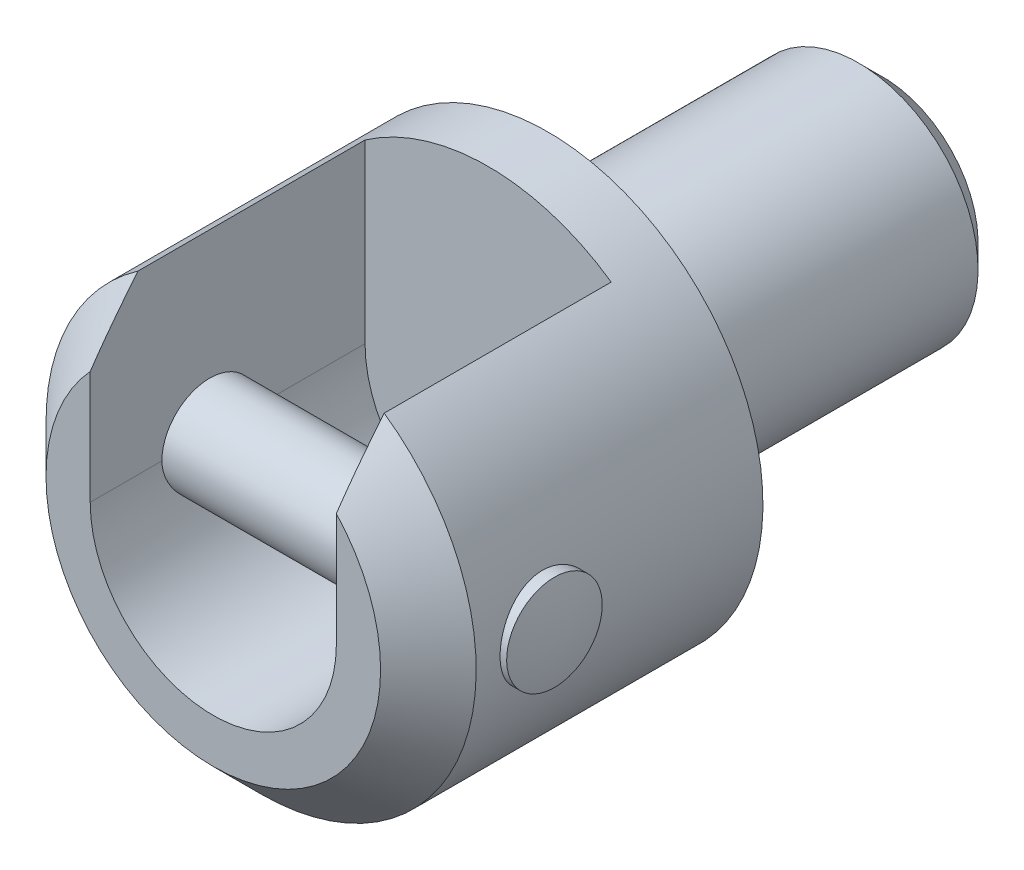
ISO-10303-21;
HEADER;
FILE_DESCRIPTION(('STEP AP214'),'2;1');
FILE_NAME('part.step','',(''),(''),'','','');
FILE_SCHEMA(('AUTOMOTIVE_DESIGN { 1 0 10303 214 1 1 1 1 }'));
ENDSEC;
DATA;
#1=APPLICATION_CONTEXT('core data for automotive mechanical design processes');
#2=APPLICATION_PROTOCOL_DEFINITION('international standard','automotive_design',2000,#1);
#3=PRODUCT_CONTEXT('',#1,'mechanical');
#4=PRODUCT('Part','Part','',(#3));
#5=PRODUCT_RELATED_PRODUCT_CATEGORY('part','',(#4));
#6=PRODUCT_DEFINITION_FORMATION('','',#4);
#7=PRODUCT_DEFINITION_CONTEXT('part definition',#1,'design');
#8=PRODUCT_DEFINITION('design','',#6,#7);
#9=PRODUCT_DEFINITION_SHAPE('','',#8);
#10=(LENGTH_UNIT() NAMED_UNIT(*) SI_UNIT(.MILLI.,.METRE.));
#11=(NAMED_UNIT(*) PLANE_ANGLE_UNIT() SI_UNIT($,.RADIAN.));
#12=(NAMED_UNIT(*) SI_UNIT($,.STERADIAN.) SOLID_ANGLE_UNIT());
#13=UNCERTAINTY_MEASURE_WITH_UNIT(LENGTH_MEASURE(1.E-05),#10,'distance_accuracy_value','');
#14=(GEOMETRIC_REPRESENTATION_CONTEXT(3) GLOBAL_UNCERTAINTY_ASSIGNED_CONTEXT((#13)) GLOBAL_UNIT_ASSIGNED_CONTEXT((#10,
#11,#12)) REPRESENTATION_CONTEXT('',''));
#15=CARTESIAN_POINT('',(0.,0.,0.));
#16=DIRECTION('',(0.,0.,1.));
#17=DIRECTION('',(1.,0.,0.));
#18=AXIS2_PLACEMENT_3D('',#15,#16,#17);
#19=CARTESIAN_POINT('',(0.,0.,-19.));
#20=DIRECTION('',(0.,0.,-1.));
#21=DIRECTION('',(0.,-1.,0.));
#22=AXIS2_PLACEMENT_3D('',#19,#20,#21);
#23=CYLINDRICAL_SURFACE('',#22,5.15);
#24=CARTESIAN_POINT('',(-4.745787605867,2.,9.));
#25=CARTESIAN_POINT('',(-4.74578221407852,2.00000555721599,9.10768759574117));
#26=CARTESIAN_POINT('',(-4.74949257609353,1.99127387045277,9.21534022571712));
#27=CARTESIAN_POINT('',(-4.76381867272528,1.95675210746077,9.42738123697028));
#28=CARTESIAN_POINT('',(-4.77443383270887,1.93096345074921,9.53176988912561));
#29=CARTESIAN_POINT('',(-4.80118956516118,1.86343197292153,9.73415403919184));
#30=CARTESIAN_POINT('',(-4.8173160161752,1.82172989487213,9.83216512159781));
#31=CARTESIAN_POINT('',(-4.85325373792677,1.72370105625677,10.0198390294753));
#32=CARTESIAN_POINT('',(-4.87306619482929,1.66736958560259,10.1094991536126));
#33=CARTESIAN_POINT('',(-4.91532813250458,1.53846039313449,10.2827132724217));
#34=CARTESIAN_POINT('',(-4.93785895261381,1.46522651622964,10.3657592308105));
#35=CARTESIAN_POINT('',(-4.98234317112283,1.30598076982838,10.5187528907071));
#36=CARTESIAN_POINT('',(-5.00429643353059,1.21996592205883,10.5886975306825));
#37=CARTESIAN_POINT('',(-5.04612768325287,1.03369463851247,10.7160006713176));
#38=CARTESIAN_POINT('',(-5.0658993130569,0.933030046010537,10.7728000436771));
#39=CARTESIAN_POINT('',(-5.10015492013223,0.722669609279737,10.8684440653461));
#40=CARTESIAN_POINT('',(-5.11464087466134,0.61297716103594,10.9072954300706));
#41=CARTESIAN_POINT('',(-5.13611497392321,0.393020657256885,10.9641380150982));
#42=CARTESIAN_POINT('',(-5.14341694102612,0.283014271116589,10.9830054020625));
#43=CARTESIAN_POINT('',(-5.15083081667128,0.0611704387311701,11.0021591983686));
#44=CARTESIAN_POINT('',(-5.15094523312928,-0.0506663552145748,11.0024520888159));
#45=CARTESIAN_POINT('',(-5.14416615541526,-0.266688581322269,10.9849430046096));
#46=CARTESIAN_POINT('',(-5.13764375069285,-0.370965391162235,10.9680992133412));
#47=CARTESIAN_POINT('',(-5.11881772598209,-0.575077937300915,10.9184161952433));
#48=CARTESIAN_POINT('',(-5.10651369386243,-0.674913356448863,10.8855758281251));
#49=CARTESIAN_POINT('',(-5.07710525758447,-0.869077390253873,10.8044235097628));
#50=CARTESIAN_POINT('',(-5.05993222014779,-0.963302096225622,10.7558888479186));
#51=CARTESIAN_POINT('',(-5.0225059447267,-1.14250906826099,10.6449286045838));
#52=CARTESIAN_POINT('',(-5.00225167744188,-1.22748822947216,10.5824983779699));
#53=CARTESIAN_POINT('',(-4.95924424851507,-1.39140954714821,10.4409792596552));
#54=CARTESIAN_POINT('',(-4.93641401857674,-1.46964567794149,10.3610947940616));
#55=CARTESIAN_POINT('',(-4.89181787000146,-1.61188932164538,10.1892271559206));
#56=CARTESIAN_POINT('',(-4.87005226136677,-1.67589270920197,10.0972404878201));
#57=CARTESIAN_POINT('',(-4.82954355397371,-1.78934089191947,9.90079948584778));
#58=CARTESIAN_POINT('',(-4.81089085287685,-1.83837640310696,9.79608860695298));
#59=CARTESIAN_POINT('',(-4.7797718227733,-1.91784369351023,9.57897888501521));
#60=CARTESIAN_POINT('',(-4.76730175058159,-1.94828673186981,9.46658474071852));
#61=CARTESIAN_POINT('',(-4.75085622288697,-1.98804023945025,9.24431318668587));
#62=CARTESIAN_POINT('',(-4.74642749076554,-1.99848032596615,9.13467170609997));
#63=CARTESIAN_POINT('',(-4.74527841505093,-2.00120953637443,8.9151380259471));
#64=CARTESIAN_POINT('',(-4.74855593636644,-1.99350368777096,8.80524590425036));
#65=CARTESIAN_POINT('',(-4.76198712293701,-1.96118636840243,8.5943723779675));
#66=CARTESIAN_POINT('',(-4.77177166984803,-1.93748144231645,8.49322572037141));
#67=CARTESIAN_POINT('',(-4.79666602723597,-1.87499807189,8.29640245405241));
#68=CARTESIAN_POINT('',(-4.81177697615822,-1.83621640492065,8.2007270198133));
#69=CARTESIAN_POINT('',(-4.84634763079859,-1.74297790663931,8.01338819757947));
#70=CARTESIAN_POINT('',(-4.86595449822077,-1.68796655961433,7.92202877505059));
#71=CARTESIAN_POINT('',(-4.90707269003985,-1.56440789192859,7.7494394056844));
#72=CARTESIAN_POINT('',(-4.92858475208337,-1.49585531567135,7.66821341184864));
#73=CARTESIAN_POINT('',(-4.9728788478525,-1.341581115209,7.51238823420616));
#74=CARTESIAN_POINT('',(-4.9956463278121,-1.25500228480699,7.43863052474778));
#75=CARTESIAN_POINT('',(-5.03848005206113,-1.07014454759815,7.30657421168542));
#76=CARTESIAN_POINT('',(-5.05854623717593,-0.971865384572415,7.24827594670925));
#77=CARTESIAN_POINT('',(-5.09374089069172,-0.766256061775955,7.1490953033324));
#78=CARTESIAN_POINT('',(-5.10887856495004,-0.658943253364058,7.10818041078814));
#79=CARTESIAN_POINT('',(-5.13251832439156,-0.438230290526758,7.0452353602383));
#80=CARTESIAN_POINT('',(-5.14102378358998,-0.324833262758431,7.02319559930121));
#81=CARTESIAN_POINT('',(-5.15009968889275,-0.102749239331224,6.99971709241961));
#82=CARTESIAN_POINT('',(-5.15112934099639,0.00579397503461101,6.99708598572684));
#83=CARTESIAN_POINT('',(-5.14635769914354,0.221715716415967,7.00938933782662));
#84=CARTESIAN_POINT('',(-5.14055733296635,0.329094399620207,7.02432141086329));
#85=CARTESIAN_POINT('',(-5.12299799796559,0.536607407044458,7.07048092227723));
#86=CARTESIAN_POINT('',(-5.11140824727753,0.636859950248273,7.10124630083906));
#87=CARTESIAN_POINT('',(-5.08349478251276,0.830774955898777,7.1777259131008));
#88=CARTESIAN_POINT('',(-5.06717017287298,0.924436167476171,7.22344297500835));
#89=CARTESIAN_POINT('',(-5.03052508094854,1.10695906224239,7.33076921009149));
#90=CARTESIAN_POINT('',(-5.01006219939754,1.19543739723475,7.3929807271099));
#91=CARTESIAN_POINT('',(-4.9676296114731,1.36105749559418,7.53060352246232));
#92=CARTESIAN_POINT('',(-4.94565935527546,1.43819508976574,7.60601963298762));
#93=CARTESIAN_POINT('',(-4.90112748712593,1.58352753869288,7.77305878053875));
#94=CARTESIAN_POINT('',(-4.87860456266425,1.65095267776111,7.86536457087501));
#95=CARTESIAN_POINT('',(-4.83690940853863,1.76939647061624,8.06069914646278));
#96=CARTESIAN_POINT('',(-4.81773801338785,1.82041104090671,8.16373059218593));
#97=CARTESIAN_POINT('',(-4.78400015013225,1.90740863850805,8.38594792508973));
#98=CARTESIAN_POINT('',(-4.76988789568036,1.94197429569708,8.50576593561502));
#99=CARTESIAN_POINT('',(-4.75078842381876,1.98825755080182,8.75040768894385));
#100=CARTESIAN_POINT('',(-4.74579385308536,1.99999356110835,8.87522731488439));
#101=CARTESIAN_POINT('',(-4.745787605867,2.,9.));
#102=B_SPLINE_CURVE_WITH_KNOTS('',3,(#24,#25,#26,#27,#28,#29,#30,#31,#32,#33,#34,#35,#36,#37,
#38,#39,#40,#41,#42,#43,#44,#45,#46,#47,#48,#49,#50,#51,#52,#53,#54,#55,#56,#57,#58,#59,#60,#61,
#62,#63,#64,#65,#66,#67,#68,#69,#70,#71,#72,#73,#74,#75,#76,#77,#78,#79,#80,#81,#82,#83,#84,#85,
#86,#87,#88,#89,#90,#91,#92,#93,#94,#95,#96,#97,#98,#99,#100,#101),.UNSPECIFIED.,.T.,.F.,(4,2,2,
2,2,2,2,2,2,2,2,2,2,2,2,2,2,2,2,2,2,2,2,2,2,2,2,2,2,2,2,2,2,2,2,2,2,2,4),(0.,0.322597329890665,
0.645167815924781,0.966917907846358,1.28877171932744,1.62625686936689,1.9638207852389,
2.31383058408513,2.66370931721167,2.99751772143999,3.33120965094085,3.64721630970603,
3.96324549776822,4.28397207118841,4.60480602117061,4.9456296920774,5.28655202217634,
5.63609937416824,5.98543483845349,6.31438296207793,6.64323995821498,6.95487354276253,
7.26657377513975,7.59048384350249,7.91451987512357,8.2608690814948,8.60722587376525,
8.95293195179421,9.29846204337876,9.62257277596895,9.94663948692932,10.2617442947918,
10.5769087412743,10.9057179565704,11.2346477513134,11.5824997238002,11.9304381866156,
12.3045187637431,12.6782975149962),.UNSPECIFIED.);
#103=CARTESIAN_POINT('',(-5.15,0.,11.));
#104=VERTEX_POINT('',#103);
#105=CARTESIAN_POINT('',(-5.15,0.,7.));
#106=VERTEX_POINT('',#105);
#107=EDGE_CURVE('E81',#104,#106,#102,.T.);
#108=ORIENTED_EDGE('',*,*,#107,.F.);
#109=DIRECTION('',(0.,0.,1.));
#110=VECTOR('',#109,1.);
#111=CARTESIAN_POINT('',(-5.15,0.,2.5));
#112=LINE('',#111,#110);
#113=CARTESIAN_POINT('',(-5.15,0.,14.));
#114=VERTEX_POINT('',#113);
#115=EDGE_CURVE('E69',#104,#114,#112,.T.);
#116=ORIENTED_EDGE('',*,*,#115,.T.);
#117=CARTESIAN_POINT('',(0.,0.,14.));
#118=DIRECTION('',(0.,0.,-1.));
#119=DIRECTION('',(0.,-1.,0.));
#120=AXIS2_PLACEMENT_3D('',#117,#118,#119);
#121=CIRCLE('',#120,5.15);
#122=CARTESIAN_POINT('',(5.15,0.,14.));
#123=VERTEX_POINT('',#122);
#124=EDGE_CURVE('E334',#123,#114,#121,.T.);
#125=ORIENTED_EDGE('',*,*,#124,.F.);
#126=DIRECTION('',(0.,0.,1.));
#127=VECTOR('',#126,1.);
#128=CARTESIAN_POINT('',(5.15,0.,2.5));
#129=LINE('',#128,#127);
#130=CARTESIAN_POINT('',(5.15,0.,11.));
#131=VERTEX_POINT('',#130);
#132=EDGE_CURVE('E366',#131,#123,#129,.T.);
#133=ORIENTED_EDGE('',*,*,#132,.F.);
#134=CARTESIAN_POINT('',(4.745787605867,2.,9.));
#135=CARTESIAN_POINT('',(4.74578221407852,2.00000555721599,8.89231240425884));
#136=CARTESIAN_POINT('',(4.74949257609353,1.99127387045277,8.78465977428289));
#137=CARTESIAN_POINT('',(4.76381867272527,1.95675210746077,8.57261876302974));
#138=CARTESIAN_POINT('',(4.77443383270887,1.93096345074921,8.46823011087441));
#139=CARTESIAN_POINT('',(4.80118956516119,1.86343197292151,8.26584596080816));
#140=CARTESIAN_POINT('',(4.81731601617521,1.82172989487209,8.16783487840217));
#141=CARTESIAN_POINT('',(4.85325373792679,1.72370105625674,7.9801609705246));
#142=CARTESIAN_POINT('',(4.87306619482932,1.66736958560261,7.89050084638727));
#143=CARTESIAN_POINT('',(4.9153281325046,1.5384603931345,7.71728672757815));
#144=CARTESIAN_POINT('',(4.93785895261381,1.4652265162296,7.63424076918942));
#145=CARTESIAN_POINT('',(4.98234317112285,1.30598076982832,7.48124710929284));
#146=CARTESIAN_POINT('',(5.00429643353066,1.21996592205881,7.41130246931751));
#147=CARTESIAN_POINT('',(5.04612768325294,1.03369463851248,7.28399932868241));
#148=CARTESIAN_POINT('',(5.06589931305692,0.933030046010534,7.22719995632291));
#149=CARTESIAN_POINT('',(5.10015492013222,0.722669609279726,7.13155593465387));
#150=CARTESIAN_POINT('',(5.11464087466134,0.612977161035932,7.0927045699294));
#151=CARTESIAN_POINT('',(5.13611497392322,0.393020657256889,7.03586198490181));
#152=CARTESIAN_POINT('',(5.14341694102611,0.283014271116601,7.01699459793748));
#153=CARTESIAN_POINT('',(5.15083081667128,0.06117043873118,6.99784080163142));
#154=CARTESIAN_POINT('',(5.15094523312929,-0.0506663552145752,6.99754791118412));
#155=CARTESIAN_POINT('',(5.14416615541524,-0.266688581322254,7.01505699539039));
#156=CARTESIAN_POINT('',(5.13764375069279,-0.370965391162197,7.03190078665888));
#157=CARTESIAN_POINT('',(5.11881772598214,-0.575077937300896,7.08158380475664));
#158=CARTESIAN_POINT('',(5.10651369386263,-0.674913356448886,7.11442417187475));
#159=CARTESIAN_POINT('',(5.07710525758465,-0.869077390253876,7.19557649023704));
#160=CARTESIAN_POINT('',(5.05993222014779,-0.963302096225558,7.24411115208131));
#161=CARTESIAN_POINT('',(5.02250594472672,-1.14250906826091,7.35507139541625));
#162=CARTESIAN_POINT('',(5.00225167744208,-1.22748822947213,7.41750162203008));
#163=CARTESIAN_POINT('',(4.9592442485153,-1.39140954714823,7.55902074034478));
#164=CARTESIAN_POINT('',(4.9364140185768,-1.46964567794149,7.63890520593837));
#165=CARTESIAN_POINT('',(4.89181787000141,-1.61188932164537,7.81077284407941));
#166=CARTESIAN_POINT('',(4.87005226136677,-1.67589270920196,7.90275951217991));
#167=CARTESIAN_POINT('',(4.82954355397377,-1.78934089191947,8.09920051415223));
#168=CARTESIAN_POINT('',(4.81089085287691,-1.83837640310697,8.20391139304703));
#169=CARTESIAN_POINT('',(4.77977182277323,-1.91784369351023,8.4210211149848));
#170=CARTESIAN_POINT('',(4.76730175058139,-1.94828673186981,8.53341525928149));
#171=CARTESIAN_POINT('',(4.75085622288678,-1.98804023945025,8.75568681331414));
#172=CARTESIAN_POINT('',(4.7464274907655,-1.99848032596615,8.86532829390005));
#173=CARTESIAN_POINT('',(4.74527841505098,-2.00120953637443,9.08486197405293));
#174=CARTESIAN_POINT('',(4.74855593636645,-1.99350368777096,9.19475409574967));
#175=CARTESIAN_POINT('',(4.761987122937,-1.96118636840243,9.40562762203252));
#176=CARTESIAN_POINT('',(4.77177166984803,-1.93748144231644,9.5067742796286));
#177=CARTESIAN_POINT('',(4.79666602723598,-1.87499807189,9.70359754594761));
#178=CARTESIAN_POINT('',(4.81177697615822,-1.83621640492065,9.79927298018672));
#179=CARTESIAN_POINT('',(4.84634763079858,-1.74297790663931,9.98661180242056));
#180=CARTESIAN_POINT('',(4.86595449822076,-1.68796655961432,10.0779712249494));
#181=CARTESIAN_POINT('',(4.90707269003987,-1.56440789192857,10.2505605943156));
#182=CARTESIAN_POINT('',(4.9285847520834,-1.49585531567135,10.3317865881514));
#183=CARTESIAN_POINT('',(4.97287884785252,-1.34158111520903,10.4876117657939));
#184=CARTESIAN_POINT('',(4.99564632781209,-1.25500228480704,10.5613694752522));
#185=CARTESIAN_POINT('',(5.03848005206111,-1.07014454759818,10.6934257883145));
#186=CARTESIAN_POINT('',(5.05854623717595,-0.971865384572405,10.7517240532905));
#187=CARTESIAN_POINT('',(5.09374089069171,-0.766256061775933,10.8509046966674));
#188=CARTESIAN_POINT('',(5.10887856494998,-0.658943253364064,10.8918195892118));
#189=CARTESIAN_POINT('',(5.13251832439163,-0.438230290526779,10.9547646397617));
#190=CARTESIAN_POINT('',(5.14102378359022,-0.32483326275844,10.9768044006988));
#191=CARTESIAN_POINT('',(5.15009968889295,-0.102749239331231,11.0002829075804));
#192=CARTESIAN_POINT('',(5.15112934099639,0.00579397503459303,11.0029140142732));
#193=CARTESIAN_POINT('',(5.14635769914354,0.221715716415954,10.9906106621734));
#194=CARTESIAN_POINT('',(5.14055733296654,0.32909439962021,10.9756785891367));
#195=CARTESIAN_POINT('',(5.12299799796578,0.536607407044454,10.9295190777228));
#196=CARTESIAN_POINT('',(5.11140824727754,0.636859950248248,10.898753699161));
#197=CARTESIAN_POINT('',(5.08349478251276,0.830774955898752,10.8222740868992));
#198=CARTESIAN_POINT('',(5.06717017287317,0.924436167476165,10.7765570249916));
#199=CARTESIAN_POINT('',(5.03052508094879,1.10695906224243,10.6692307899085));
#200=CARTESIAN_POINT('',(5.01006219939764,1.19543739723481,10.6070192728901));
#201=CARTESIAN_POINT('',(4.96762961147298,1.3610574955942,10.4693964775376));
#202=CARTESIAN_POINT('',(4.94565935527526,1.43819508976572,10.3939803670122));
#203=CARTESIAN_POINT('',(4.90112748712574,1.58352753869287,10.226941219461));
#204=CARTESIAN_POINT('',(4.87860456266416,1.6509526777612,10.1346354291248));
#205=CARTESIAN_POINT('',(4.83690940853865,1.76939647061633,9.93930085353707));
#206=CARTESIAN_POINT('',(4.81773801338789,1.82041104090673,9.83626940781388));
#207=CARTESIAN_POINT('',(4.78400015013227,1.90740863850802,9.61405207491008));
#208=CARTESIAN_POINT('',(4.76988789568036,1.94197429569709,9.49423406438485));
#209=CARTESIAN_POINT('',(4.75078842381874,1.98825755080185,9.24959231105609));
#210=CARTESIAN_POINT('',(4.74579385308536,1.99999356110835,9.12477268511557));
#211=CARTESIAN_POINT('',(4.745787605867,2.,9.));
#212=B_SPLINE_CURVE_WITH_KNOTS('',3,(#134,#135,#136,#137,#138,#139,#140,#141,#142,#143,#144,
#145,#146,#147,#148,#149,#150,#151,#152,#153,#154,#155,#156,#157,#158,#159,#160,#161,#162,#163,
#164,#165,#166,#167,#168,#169,#170,#171,#172,#173,#174,#175,#176,#177,#178,#179,#180,#181,#182,
#183,#184,#185,#186,#187,#188,#189,#190,#191,#192,#193,#194,#195,#196,#197,#198,#199,#200,#201,
#202,#203,#204,#205,#206,#207,#208,#209,#210,#211),.UNSPECIFIED.,.T.,.F.,(4,2,2,2,2,2,2,2,2,2,2,
2,2,2,2,2,2,2,2,2,2,2,2,2,2,2,2,2,2,2,2,2,2,2,2,2,2,2,4),(0.,0.322597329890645,
0.645167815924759,0.966917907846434,1.28877171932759,1.62625686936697,1.96382078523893,
2.31383058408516,2.66370931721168,2.99751772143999,3.33120965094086,3.64721630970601,
3.96324549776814,4.28397207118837,4.60480602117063,4.94562969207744,5.28655202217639,
5.6360993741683,5.98543483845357,6.31438296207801,6.64323995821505,6.9548735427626,
7.26657377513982,7.59048384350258,7.91451987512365,8.2608690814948,8.60722587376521,
8.95293195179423,9.29846204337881,9.62257277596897,9.94663948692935,10.2617442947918,
10.5769087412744,10.9057179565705,11.2346477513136,11.5824997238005,11.9304381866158,
12.3045187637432,12.6782975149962),.UNSPECIFIED.);
#213=CARTESIAN_POINT('',(5.15,0.,7.));
#214=VERTEX_POINT('',#213);
#215=EDGE_CURVE('E96',#214,#131,#212,.T.);
#216=ORIENTED_EDGE('',*,*,#215,.F.);
#217=CARTESIAN_POINT('',(5.15,0.,2.5));
#218=VERTEX_POINT('',#217);
#219=EDGE_CURVE('E365',#218,#214,#129,.T.);
#220=ORIENTED_EDGE('',*,*,#219,.F.);
#221=CARTESIAN_POINT('',(0.,0.,2.5));
#222=DIRECTION('',(0.,0.,-1.));
#223=DIRECTION('',(0.,-1.,0.));
#224=AXIS2_PLACEMENT_3D('',#221,#222,#223);
#225=CIRCLE('',#224,5.15);
#226=CARTESIAN_POINT('',(-5.15,0.,2.5));
#227=VERTEX_POINT('',#226);
#228=EDGE_CURVE('E336',#218,#227,#225,.T.);
#229=ORIENTED_EDGE('',*,*,#228,.T.);
#230=EDGE_CURVE('E77',#227,#106,#112,.T.);
#231=ORIENTED_EDGE('',*,*,#230,.T.);
#232=EDGE_LOOP('',(#108,#116,#125,#133,#216,#220,#229,#231));
#233=FACE_BOUND('',#232,.T.);
#234=ADVANCED_FACE('F14',(#233),#23,.F.);
#235=CARTESIAN_POINT('',(0.,0.,-19.));
#236=DIRECTION('',(0.,0.,-1.));
#237=DIRECTION('',(0.,-1.,0.));
#238=AXIS2_PLACEMENT_3D('',#235,#236,#237);
#239=CYLINDRICAL_SURFACE('',#238,9.);
#240=CARTESIAN_POINT('',(8.774964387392,2.,9.));
#241=CARTESIAN_POINT('',(8.7749666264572,1.99999624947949,8.88915763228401));
#242=CARTESIAN_POINT('',(8.77708745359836,1.99075413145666,8.77827058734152));
#243=CARTESIAN_POINT('',(8.78532539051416,1.95407223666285,8.55965317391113));
#244=CARTESIAN_POINT('',(8.79144532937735,1.92661957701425,8.45192509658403));
#245=CARTESIAN_POINT('',(8.80695492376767,1.85442638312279,8.24281957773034));
#246=CARTESIAN_POINT('',(8.81634092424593,1.8097051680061,8.1414351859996));
#247=CARTESIAN_POINT('',(8.83732066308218,1.70430003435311,7.94760499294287));
#248=CARTESIAN_POINT('',(8.84891437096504,1.64361633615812,7.85515906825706));
#249=CARTESIAN_POINT('',(8.8732290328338,1.50688107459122,7.68021742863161));
#250=CARTESIAN_POINT('',(8.88596479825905,1.43060369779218,7.59790023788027));
#251=CARTESIAN_POINT('',(8.91099903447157,1.26533367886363,7.44711724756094));
#252=CARTESIAN_POINT('',(8.92329747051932,1.17634002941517,7.3786525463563));
#253=CARTESIAN_POINT('',(8.94623292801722,0.986963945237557,7.25680924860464));
#254=CARTESIAN_POINT('',(8.95685043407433,0.88646821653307,7.20360275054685));
#255=CARTESIAN_POINT('',(8.97506024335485,0.67768633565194,7.11490019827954));
#256=CARTESIAN_POINT('',(8.98265289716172,0.569401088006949,7.07940209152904));
#257=CARTESIAN_POINT('',(8.99385284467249,0.349970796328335,7.02768656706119));
#258=CARTESIAN_POINT('',(8.99752254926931,0.238900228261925,7.0111668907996));
#259=CARTESIAN_POINT('',(9.00067948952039,0.0155076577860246,6.99693172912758));
#260=CARTESIAN_POINT('',(9.00016721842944,-0.0968141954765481,6.99921402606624));
#261=CARTESIAN_POINT('',(8.9950654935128,-0.317435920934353,7.02229372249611));
#262=CARTESIAN_POINT('',(8.99054779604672,-0.425771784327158,7.04276527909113));
#263=CARTESIAN_POINT('',(8.97802477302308,-0.637430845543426,7.10112266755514));
#264=CARTESIAN_POINT('',(8.97001928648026,-0.740753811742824,7.13900930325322));
#265=CARTESIAN_POINT('',(8.95130538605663,-0.940353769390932,7.23140697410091));
#266=CARTESIAN_POINT('',(8.94057712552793,-1.036572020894,7.28604071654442));
#267=CARTESIAN_POINT('',(8.91759271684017,-1.21859313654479,7.41029009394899));
#268=CARTESIAN_POINT('',(8.90533635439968,-1.30439453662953,7.47990783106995));
#269=CARTESIAN_POINT('',(8.88033165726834,-1.46508498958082,7.63392019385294));
#270=CARTESIAN_POINT('',(8.86757840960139,-1.53970021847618,7.71859997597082));
#271=CARTESIAN_POINT('',(8.84326321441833,-1.67372303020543,7.89940274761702));
#272=CARTESIAN_POINT('',(8.83170130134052,-1.73313017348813,7.99552606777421));
#273=CARTESIAN_POINT('',(8.811064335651,-1.83517765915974,8.19693988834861));
#274=CARTESIAN_POINT('',(8.80199720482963,-1.87776477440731,8.30225822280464));
#275=CARTESIAN_POINT('',(8.78748514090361,-1.94455269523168,8.51880617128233));
#276=CARTESIAN_POINT('',(8.78203961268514,-1.96875652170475,8.63003481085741));
#277=CARTESIAN_POINT('',(8.77550908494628,-1.99766298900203,8.85273998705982));
#278=CARTESIAN_POINT('',(8.77433480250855,-2.00276498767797,8.96416213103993));
#279=CARTESIAN_POINT('',(8.77623864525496,-1.99440547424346,9.18626492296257));
#280=CARTESIAN_POINT('',(8.77931646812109,-1.98094528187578,9.29694562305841));
#281=CARTESIAN_POINT('',(8.7892932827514,-1.93619037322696,9.51302353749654));
#282=CARTESIAN_POINT('',(8.79614483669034,-1.90511692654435,9.61846897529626));
#283=CARTESIAN_POINT('',(8.81285408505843,-1.82625775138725,9.82265663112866));
#284=CARTESIAN_POINT('',(8.8227120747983,-1.77847038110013,9.92139818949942));
#285=CARTESIAN_POINT('',(8.84451874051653,-1.66666470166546,10.1110996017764));
#286=CARTESIAN_POINT('',(8.8564980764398,-1.60240114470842,10.2019113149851));
#287=CARTESIAN_POINT('',(8.88111742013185,-1.45978704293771,10.3716083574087));
#288=CARTESIAN_POINT('',(8.89375751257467,-1.38143468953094,10.4504921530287));
#289=CARTESIAN_POINT('',(8.91856933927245,-1.2110572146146,10.5956513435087));
#290=CARTESIAN_POINT('',(8.9307273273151,-1.11879740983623,10.6616540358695));
#291=CARTESIAN_POINT('',(8.95294911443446,-0.924268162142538,10.777224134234));
#292=CARTESIAN_POINT('',(8.96301301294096,-0.821999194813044,10.8267923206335));
#293=CARTESIAN_POINT('',(8.97985488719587,-0.611001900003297,10.9077101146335));
#294=CARTESIAN_POINT('',(8.9866540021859,-0.502320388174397,10.9391771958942));
#295=CARTESIAN_POINT('',(8.99629176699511,-0.281045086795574,10.9833651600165));
#296=CARTESIAN_POINT('',(8.99913101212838,-0.168451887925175,10.9960888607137));
#297=CARTESIAN_POINT('',(9.00051075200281,0.05486484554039,11.0022987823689));
#298=CARTESIAN_POINT('',(8.99914211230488,0.165576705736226,10.9961916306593));
#299=CARTESIAN_POINT('',(8.99245526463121,0.384354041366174,10.9658250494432));
#300=CARTESIAN_POINT('',(8.9871371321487,0.492419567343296,10.9415659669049));
#301=CARTESIAN_POINT('',(8.97315637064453,0.702510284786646,10.8757816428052));
#302=CARTESIAN_POINT('',(8.96450524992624,0.804554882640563,10.8343157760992));
#303=CARTESIAN_POINT('',(8.94478087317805,1.00029152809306,10.7353521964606));
#304=CARTESIAN_POINT('',(8.9337073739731,1.09398273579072,10.6778528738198));
#305=CARTESIAN_POINT('',(8.91007482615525,1.27233089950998,10.5471377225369));
#306=CARTESIAN_POINT('',(8.89749099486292,1.35677575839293,10.4736369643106));
#307=CARTESIAN_POINT('',(8.87238707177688,1.51227173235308,10.3135778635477));
#308=CARTESIAN_POINT('',(8.85986699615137,1.58331959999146,10.22701636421));
#309=CARTESIAN_POINT('',(8.83611370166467,1.71095851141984,10.0418455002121));
#310=CARTESIAN_POINT('',(8.82490079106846,1.76733485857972,9.94308538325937));
#311=CARTESIAN_POINT('',(8.80528840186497,1.86260026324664,9.73726310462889));
#312=CARTESIAN_POINT('',(8.79688657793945,1.90150390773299,9.63020795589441));
#313=CARTESIAN_POINT('',(8.78537621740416,1.95389349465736,9.43589352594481));
#314=CARTESIAN_POINT('',(8.78149804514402,1.97114982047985,9.34967657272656));
#315=CARTESIAN_POINT('',(8.7762913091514,1.99420426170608,9.17564904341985));
#316=CARTESIAN_POINT('',(8.77496261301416,2.00000297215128,9.08783855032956));
#317=CARTESIAN_POINT('',(8.774964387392,2.,9.));
#318=B_SPLINE_CURVE_WITH_KNOTS('',3,(#240,#241,#242,#243,#244,#245,#246,#247,#248,#249,#250,
#251,#252,#253,#254,#255,#256,#257,#258,#259,#260,#261,#262,#263,#264,#265,#266,#267,#268,#269,
#270,#271,#272,#273,#274,#275,#276,#277,#278,#279,#280,#281,#282,#283,#284,#285,#286,#287,#288,
#289,#290,#291,#292,#293,#294,#295,#296,#297,#298,#299,#300,#301,#302,#303,#304,#305,#306,#307,
#308,#309,#310,#311,#312,#313,#314,#315,#316,#317),.UNSPECIFIED.,.T.,.F.,(4,2,2,2,2,2,2,2,2,2,2,
2,2,2,2,2,2,2,2,2,2,2,2,2,2,2,2,2,2,2,2,2,2,2,2,2,2,2,4),(0.,0.33220511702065,0.664645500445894,
0.996715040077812,1.32877999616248,1.66604593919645,2.00333861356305,2.3442981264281,
2.68521811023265,3.02062971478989,3.35600175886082,3.68548441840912,4.01498228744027,
4.34695458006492,4.67897347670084,5.01812047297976,5.35727727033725,5.69749889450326,
6.03766459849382,6.37067749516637,6.70366671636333,7.0325625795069,7.36149075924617,
7.695632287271,8.02981674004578,8.37045046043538,8.71106800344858,9.04944929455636,
9.38777970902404,9.71885587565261,10.0499257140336,10.3798625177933,10.7098324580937,
11.0462446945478,11.3827383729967,11.7239097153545,12.064795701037,12.3280698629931,
12.5913303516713),.UNSPECIFIED.);
#319=CARTESIAN_POINT('',(8.774964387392,2.,9.));
#320=VERTEX_POINT('',#319);
#321=EDGE_CURVE('E98',#320,#320,#318,.T.);
#322=ORIENTED_EDGE('',*,*,#321,.T.);
#323=EDGE_LOOP('',(#322));
#324=FACE_BOUND('',#323,.T.);
#325=DIRECTION('',(0.,0.,-1.));
#326=VECTOR('',#325,1.);
#327=CARTESIAN_POINT('',(5.15,7.38088748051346,-19.));
#328=LINE('',#327,#326);
#329=CARTESIAN_POINT('',(5.15,7.38088748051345,12.));
#330=VERTEX_POINT('',#329);
#331=CARTESIAN_POINT('',(5.15,7.38088748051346,2.5));
#332=VERTEX_POINT('',#331);
#333=EDGE_CURVE('E311',#330,#332,#328,.T.);
#334=ORIENTED_EDGE('',*,*,#333,.F.);
#335=CARTESIAN_POINT('',(0.,0.,12.));
#336=DIRECTION('',(0.,0.,-1.));
#337=DIRECTION('',(0.,-1.,0.));
#338=AXIS2_PLACEMENT_3D('',#335,#336,#337);
#339=CIRCLE('',#338,9.);
#340=CARTESIAN_POINT('',(-5.15,7.38088748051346,12.));
#341=VERTEX_POINT('',#340);
#342=EDGE_CURVE('E319',#330,#341,#339,.T.);
#343=ORIENTED_EDGE('',*,*,#342,.T.);
#344=DIRECTION('',(0.,0.,-1.));
#345=VECTOR('',#344,1.);
#346=CARTESIAN_POINT('',(-5.15,7.38088748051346,-19.));
#347=LINE('',#346,#345);
#348=CARTESIAN_POINT('',(-5.15,7.38088748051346,2.5));
#349=VERTEX_POINT('',#348);
#350=EDGE_CURVE('E354',#349,#341,#347,.F.);
#351=ORIENTED_EDGE('',*,*,#350,.F.);
#352=CARTESIAN_POINT('',(0.,0.,2.5));
#353=DIRECTION('',(0.,0.,-1.));
#354=DIRECTION('',(0.,-1.,0.));
#355=AXIS2_PLACEMENT_3D('',#352,#353,#354);
#356=CIRCLE('',#355,9.);
#357=EDGE_CURVE('E344',#332,#349,#356,.F.);
#358=ORIENTED_EDGE('',*,*,#357,.F.);
#359=EDGE_LOOP('',(#334,#343,#351,#358));
#360=FACE_BOUND('',#359,.T.);
#361=CARTESIAN_POINT('',(0.,0.,0.));
#362=DIRECTION('',(0.,0.,-1.));
#363=DIRECTION('',(0.,-1.,0.));
#364=AXIS2_PLACEMENT_3D('',#361,#362,#363);
#365=CIRCLE('',#364,9.);
#366=CARTESIAN_POINT('',(0.,-9.,0.));
#367=VERTEX_POINT('',#366);
#368=EDGE_CURVE('E316',#367,#367,#365,.T.);
#369=ORIENTED_EDGE('',*,*,#368,.F.);
#370=EDGE_LOOP('',(#369));
#371=FACE_BOUND('',#370,.T.);
#372=CARTESIAN_POINT('',(-8.7749643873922,2.,9.));
#373=CARTESIAN_POINT('',(-8.77496662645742,1.99999624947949,9.11084236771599));
#374=CARTESIAN_POINT('',(-8.77708745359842,1.99075413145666,9.22172941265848));
#375=CARTESIAN_POINT('',(-8.7853253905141,1.95407223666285,9.44034682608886));
#376=CARTESIAN_POINT('',(-8.79144532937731,1.92661957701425,9.54807490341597));
#377=CARTESIAN_POINT('',(-8.80695492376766,1.85442638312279,9.75718042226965));
#378=CARTESIAN_POINT('',(-8.81634092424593,1.8097051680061,9.85856481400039));
#379=CARTESIAN_POINT('',(-8.83732066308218,1.70430003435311,10.0523950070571));
#380=CARTESIAN_POINT('',(-8.84891437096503,1.64361633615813,10.1448409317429));
#381=CARTESIAN_POINT('',(-8.87322903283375,1.50688107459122,10.3197825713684));
#382=CARTESIAN_POINT('',(-8.88596479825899,1.43060369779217,10.4020997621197));
#383=CARTESIAN_POINT('',(-8.91099903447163,1.26533367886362,10.5528827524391));
#384=CARTESIAN_POINT('',(-8.92329747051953,1.17634002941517,10.6213474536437));
#385=CARTESIAN_POINT('',(-8.94623292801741,0.986963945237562,10.7431907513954));
#386=CARTESIAN_POINT('',(-8.95685043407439,0.886468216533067,10.7963972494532));
#387=CARTESIAN_POINT('',(-8.9750602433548,0.677686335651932,10.8850998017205));
#388=CARTESIAN_POINT('',(-8.9826528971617,0.569401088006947,10.920597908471));
#389=CARTESIAN_POINT('',(-8.99385284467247,0.349970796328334,10.9723134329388));
#390=CARTESIAN_POINT('',(-8.99752254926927,0.238900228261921,10.9888331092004));
#391=CARTESIAN_POINT('',(-9.00067948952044,0.01550765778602,11.0030682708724));
#392=CARTESIAN_POINT('',(-9.00016721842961,-0.0968141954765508,11.0007859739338));
#393=CARTESIAN_POINT('',(-8.995065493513,-0.317435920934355,10.9777062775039));
#394=CARTESIAN_POINT('',(-8.99054779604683,-0.42577178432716,10.9572347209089));
#395=CARTESIAN_POINT('',(-8.97802477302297,-0.637430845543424,10.8988773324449));
#396=CARTESIAN_POINT('',(-8.97001928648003,-0.740753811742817,10.8609906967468));
#397=CARTESIAN_POINT('',(-8.95130538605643,-0.94035376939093,10.7685930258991));
#398=CARTESIAN_POINT('',(-8.94057712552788,-1.03657202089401,10.7139592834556));
#399=CARTESIAN_POINT('',(-8.91759271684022,-1.2185931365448,10.589709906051));
#400=CARTESIAN_POINT('',(-8.90533635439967,-1.30439453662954,10.5200921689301));
#401=CARTESIAN_POINT('',(-8.8803316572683,-1.46508498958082,10.3660798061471));
#402=CARTESIAN_POINT('',(-8.86757840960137,-1.53970021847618,10.2814000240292));
#403=CARTESIAN_POINT('',(-8.84326321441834,-1.67372303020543,10.100597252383));
#404=CARTESIAN_POINT('',(-8.83170130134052,-1.73313017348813,10.0044739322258));
#405=CARTESIAN_POINT('',(-8.811064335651,-1.83517765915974,9.80306011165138));
#406=CARTESIAN_POINT('',(-8.80199720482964,-1.87776477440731,9.69774177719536));
#407=CARTESIAN_POINT('',(-8.7874851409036,-1.94455269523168,9.48119382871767));
#408=CARTESIAN_POINT('',(-8.78203961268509,-1.96875652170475,9.3699651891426));
#409=CARTESIAN_POINT('',(-8.77550908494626,-1.99766298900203,9.14726001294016));
#410=CARTESIAN_POINT('',(-8.77433480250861,-2.00276498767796,9.03583786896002));
#411=CARTESIAN_POINT('',(-8.7762386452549,-1.99440547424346,8.81373507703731));
#412=CARTESIAN_POINT('',(-8.77931646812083,-1.98094528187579,8.70305437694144));
#413=CARTESIAN_POINT('',(-8.78929328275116,-1.93619037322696,8.48697646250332));
#414=CARTESIAN_POINT('',(-8.79614483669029,-1.90511692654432,8.38153102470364));
#415=CARTESIAN_POINT('',(-8.8128540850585,-1.82625775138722,8.1773433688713));
#416=CARTESIAN_POINT('',(-8.82271207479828,-1.77847038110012,8.07860181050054));
#417=CARTESIAN_POINT('',(-8.84451874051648,-1.66666470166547,7.88890039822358));
#418=CARTESIAN_POINT('',(-8.8564980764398,-1.60240114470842,7.79808868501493));
#419=CARTESIAN_POINT('',(-8.88111742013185,-1.4597870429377,7.62839164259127));
#420=CARTESIAN_POINT('',(-8.89375751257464,-1.38143468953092,7.54950784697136));
#421=CARTESIAN_POINT('',(-8.91856933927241,-1.21105721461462,7.40434865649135));
#422=CARTESIAN_POINT('',(-8.9307273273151,-1.11879740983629,7.3383459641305));
#423=CARTESIAN_POINT('',(-8.95294911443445,-0.924268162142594,7.22277586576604));
#424=CARTESIAN_POINT('',(-8.96301301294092,-0.821999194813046,7.17320767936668));
#425=CARTESIAN_POINT('',(-8.97985488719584,-0.611001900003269,7.09228988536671));
#426=CARTESIAN_POINT('',(-8.9866540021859,-0.502320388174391,7.06082280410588));
#427=CARTESIAN_POINT('',(-8.99629176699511,-0.281045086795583,7.01663483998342));
#428=CARTESIAN_POINT('',(-8.99913101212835,-0.168451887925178,7.00391113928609));
#429=CARTESIAN_POINT('',(-9.00051075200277,0.0548648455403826,6.99770121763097));
#430=CARTESIAN_POINT('',(-8.99914211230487,0.165576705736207,7.00380836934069));
#431=CARTESIAN_POINT('',(-8.99245526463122,0.384354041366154,7.0341749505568));
#432=CARTESIAN_POINT('',(-8.98713713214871,0.492419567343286,7.05843403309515));
#433=CARTESIAN_POINT('',(-8.97315637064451,0.702510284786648,7.12421835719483));
#434=CARTESIAN_POINT('',(-8.9645052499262,0.804554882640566,7.16568422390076));
#435=CARTESIAN_POINT('',(-8.94478087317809,1.00029152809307,7.26464780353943));
#436=CARTESIAN_POINT('',(-8.93370737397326,1.09398273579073,7.3221471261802));
#437=CARTESIAN_POINT('',(-8.91007482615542,1.27233089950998,7.45286227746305));
#438=CARTESIAN_POINT('',(-8.89749099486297,1.35677575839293,7.52636303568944));
#439=CARTESIAN_POINT('',(-8.87238707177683,1.51227173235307,7.68642213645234));
#440=CARTESIAN_POINT('',(-8.85986699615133,1.58331959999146,7.77298363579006));
#441=CARTESIAN_POINT('',(-8.83611370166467,1.71095851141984,7.95815449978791));
#442=CARTESIAN_POINT('',(-8.82490079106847,1.76733485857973,8.05691461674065));
#443=CARTESIAN_POINT('',(-8.80528840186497,1.86260026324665,8.26273689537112));
#444=CARTESIAN_POINT('',(-8.79688657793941,1.901503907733,8.36979204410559));
#445=CARTESIAN_POINT('',(-8.7853762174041,1.95389349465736,8.56410647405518));
#446=CARTESIAN_POINT('',(-8.78149804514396,1.97114982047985,8.65032342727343));
#447=CARTESIAN_POINT('',(-8.77629130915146,1.99420426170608,8.82435095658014));
#448=CARTESIAN_POINT('',(-8.77496261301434,2.00000297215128,8.91216144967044));
#449=CARTESIAN_POINT('',(-8.7749643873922,2.,9.));
#450=B_SPLINE_CURVE_WITH_KNOTS('',3,(#372,#373,#374,#375,#376,#377,#378,#379,#380,#381,#382,
#383,#384,#385,#386,#387,#388,#389,#390,#391,#392,#393,#394,#395,#396,#397,#398,#399,#400,#401,
#402,#403,#404,#405,#406,#407,#408,#409,#410,#411,#412,#413,#414,#415,#416,#417,#418,#419,#420,
#421,#422,#423,#424,#425,#426,#427,#428,#429,#430,#431,#432,#433,#434,#435,#436,#437,#438,#439,
#440,#441,#442,#443,#444,#445,#446,#447,#448,#449),.UNSPECIFIED.,.T.,.F.,(4,2,2,2,2,2,2,2,2,2,2,
2,2,2,2,2,2,2,2,2,2,2,2,2,2,2,2,2,2,2,2,2,2,2,2,2,2,2,4),(0.,0.33220511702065,0.664645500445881,
0.996715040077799,1.32877999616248,1.66604593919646,2.00333861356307,2.3442981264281,
2.68521811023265,3.02062971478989,3.35600175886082,3.68548441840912,4.0149822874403,
4.34695458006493,4.67897347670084,5.01812047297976,5.35727727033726,5.69749889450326,
6.03766459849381,6.37067749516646,6.70366671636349,7.03256257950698,7.3614907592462,
7.69563228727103,8.02981674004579,8.37045046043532,8.71106800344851,9.04944929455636,
9.38777970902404,9.7188558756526,10.0499257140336,10.3798625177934,10.7098324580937,
11.0462446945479,11.3827383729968,11.7239097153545,12.0647957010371,12.3280698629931,
12.5913303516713),.UNSPECIFIED.);
#451=CARTESIAN_POINT('',(-8.7749643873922,2.,9.));
#452=VERTEX_POINT('',#451);
#453=EDGE_CURVE('E127',#452,#452,#450,.T.);
#454=ORIENTED_EDGE('',*,*,#453,.T.);
#455=EDGE_LOOP('',(#454));
#456=FACE_BOUND('',#455,.T.);
#457=ADVANCED_FACE('F135',(#324,#360,#371,#456),#239,.T.);
#458=CARTESIAN_POINT('',(5.15,0.,2.5));
#459=DIRECTION('',(1.,0.,0.));
#460=DIRECTION('',(0.,1.,0.));
#461=AXIS2_PLACEMENT_3D('',#458,#459,#460);
#462=PLANE('',#461);
#463=CARTESIAN_POINT('',(5.15,0.,9.));
#464=DIRECTION('',(1.,0.,0.));
#465=DIRECTION('',(0.,1.,0.));
#466=AXIS2_PLACEMENT_3D('',#463,#464,#465);
#467=CIRCLE('',#466,2.);
#468=EDGE_CURVE('E29',#131,#214,#467,.F.);
#469=ORIENTED_EDGE('',*,*,#468,.F.);
#470=ORIENTED_EDGE('',*,*,#132,.T.);
#471=DIRECTION('',(0.,1.,0.));
#472=VECTOR('',#471,1.);
#473=CARTESIAN_POINT('',(5.15,0.,14.));
#474=LINE('',#473,#472);
#475=CARTESIAN_POINT('',(5.15,4.74104418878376,14.));
#476=VERTEX_POINT('',#475);
#477=EDGE_CURVE('E133',#123,#476,#474,.T.);
#478=ORIENTED_EDGE('',*,*,#477,.T.);
#479=CARTESIAN_POINT('',(5.15,12.799764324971,7.20302689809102));
#480=CARTESIAN_POINT('',(5.15,12.5156792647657,7.46655191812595));
#481=CARTESIAN_POINT('',(5.15,12.2310086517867,7.72944966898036));
#482=CARTESIAN_POINT('',(5.15,11.6601829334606,8.25365129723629));
#483=CARTESIAN_POINT('',(5.15,11.3740277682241,8.51495510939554));
#484=CARTESIAN_POINT('',(5.15,10.799787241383,9.03574894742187));
#485=CARTESIAN_POINT('',(5.15,10.5117009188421,9.29523791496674));
#486=CARTESIAN_POINT('',(5.15,9.93333868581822,9.81175781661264));
#487=CARTESIAN_POINT('',(5.15,9.6430628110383,10.0687887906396));
#488=CARTESIAN_POINT('',(5.15,9.0634419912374,10.5765087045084));
#489=CARTESIAN_POINT('',(5.15,8.77413135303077,10.8272367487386));
#490=CARTESIAN_POINT('',(5.15,8.19213146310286,11.3247388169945));
#491=CARTESIAN_POINT('',(5.15,7.89944228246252,11.571512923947));
#492=CARTESIAN_POINT('',(5.15,7.30960888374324,12.0598932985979));
#493=CARTESIAN_POINT('',(5.15,7.01246321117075,12.3014978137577));
#494=CARTESIAN_POINT('',(5.15,6.41247883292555,12.7775368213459));
#495=CARTESIAN_POINT('',(5.15,6.10964060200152,13.0119719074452));
#496=CARTESIAN_POINT('',(5.15,5.65022248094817,13.3555693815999));
#497=CARTESIAN_POINT('',(5.15,5.4965069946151,13.4685612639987));
#498=CARTESIAN_POINT('',(5.15,5.18686942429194,13.6914747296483));
#499=CARTESIAN_POINT('',(5.15,5.03094743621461,13.80139644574));
#500=CARTESIAN_POINT('',(5.15,4.71676045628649,14.0173550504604));
#501=CARTESIAN_POINT('',(5.15,4.55849918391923,14.1233973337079));
#502=CARTESIAN_POINT('',(5.15,4.23900861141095,14.3308969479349));
#503=CARTESIAN_POINT('',(5.15,4.07777958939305,14.4323547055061));
#504=CARTESIAN_POINT('',(5.15,3.75071570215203,14.6302832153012));
#505=CARTESIAN_POINT('',(5.15,3.58485640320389,14.7267138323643));
#506=CARTESIAN_POINT('',(5.15,3.24918577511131,14.9122937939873));
#507=CARTESIAN_POINT('',(5.15,3.07937617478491,15.0014462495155));
#508=CARTESIAN_POINT('',(5.15,2.73435733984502,15.1710647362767));
#509=CARTESIAN_POINT('',(5.15,2.55912547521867,15.2514854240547));
#510=CARTESIAN_POINT('',(5.15,2.20349981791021,15.4007130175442));
#511=CARTESIAN_POINT('',(5.15,2.02309858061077,15.4695020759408));
#512=CARTESIAN_POINT('',(5.15,1.84009257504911,15.5311389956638));
#513=B_SPLINE_CURVE_WITH_KNOTS('',3,(#479,#480,#481,#482,#483,#484,#485,#486,#487,#488,#489,
#490,#491,#492,#493,#494,#495,#496,#497,#498,#499,#500,#501,#502,#503,#504,#505,#506,#507,#508,
#509,#510,#511,#512),.UNSPECIFIED.,.F.,.F.,(4,2,2,2,2,2,2,2,2,2,2,2,2,2,2,2,4),(0.,
1.16247796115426,2.32500318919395,3.48815766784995,4.65129322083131,5.79978195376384,
6.94824656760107,8.09709454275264,9.24584712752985,9.81814698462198,10.390422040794,
10.9618684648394,11.5332616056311,12.1086771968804,12.6838455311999,13.2618706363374,
13.8407747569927),.UNSPECIFIED.);
#514=EDGE_CURVE('E347',#330,#476,#513,.T.);
#515=ORIENTED_EDGE('',*,*,#514,.F.);
#516=ORIENTED_EDGE('',*,*,#333,.T.);
#517=DIRECTION('',(0.,1.,0.));
#518=VECTOR('',#517,1.);
#519=CARTESIAN_POINT('',(5.15,0.,2.5));
#520=LINE('',#519,#518);
#521=EDGE_CURVE('E370',#218,#332,#520,.T.);
#522=ORIENTED_EDGE('',*,*,#521,.F.);
#523=ORIENTED_EDGE('',*,*,#219,.T.);
#524=EDGE_LOOP('',(#469,#470,#478,#515,#516,#522,#523));
#525=FACE_BOUND('',#524,.T.);
#526=ADVANCED_FACE('F140',(#525),#462,.F.);
#527=CARTESIAN_POINT('',(-5.15,10.6873479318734,2.5));
#528=DIRECTION('',(-1.,0.,0.));
#529=DIRECTION('',(0.,-1.,0.));
#530=AXIS2_PLACEMENT_3D('',#527,#528,#529);
#531=PLANE('',#530);
#532=CARTESIAN_POINT('',(-5.15,0.,9.));
#533=DIRECTION('',(-1.,0.,0.));
#534=DIRECTION('',(0.,-1.,0.));
#535=AXIS2_PLACEMENT_3D('',#532,#533,#534);
#536=CIRCLE('',#535,2.);
#537=EDGE_CURVE('E9',#106,#104,#536,.F.);
#538=ORIENTED_EDGE('',*,*,#537,.F.);
#539=ORIENTED_EDGE('',*,*,#230,.F.);
#540=DIRECTION('',(0.,-1.,0.));
#541=VECTOR('',#540,1.);
#542=CARTESIAN_POINT('',(-5.15,10.6873479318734,2.5));
#543=LINE('',#542,#541);
#544=EDGE_CURVE('E78',#349,#227,#543,.T.);
#545=ORIENTED_EDGE('',*,*,#544,.F.);
#546=ORIENTED_EDGE('',*,*,#350,.T.);
#547=CARTESIAN_POINT('',(-5.15,1.84009257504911,15.5311389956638));
#548=CARTESIAN_POINT('',(-5.15,1.99988035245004,15.4773428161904));
#549=CARTESIAN_POINT('',(-5.15,2.15770194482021,15.4180607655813));
#550=CARTESIAN_POINT('',(-5.15,2.46940676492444,15.2903434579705));
#551=CARTESIAN_POINT('',(-5.15,2.62329424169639,15.2219186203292));
#552=CARTESIAN_POINT('',(-5.15,2.92694938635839,15.0778589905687));
#553=CARTESIAN_POINT('',(-5.15,3.07672965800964,15.0022504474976));
#554=CARTESIAN_POINT('',(-5.15,3.37310929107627,14.8449547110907));
#555=CARTESIAN_POINT('',(-5.15,3.5197076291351,14.7632655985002));
#556=CARTESIAN_POINT('',(-5.15,3.80898742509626,14.5955410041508));
#557=CARTESIAN_POINT('',(-5.15,3.951689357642,14.5095406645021));
#558=CARTESIAN_POINT('',(-5.15,4.23459354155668,14.3335133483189));
#559=CARTESIAN_POINT('',(-5.15,4.37479556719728,14.2434860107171));
#560=CARTESIAN_POINT('',(-5.15,4.79228187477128,13.9683249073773));
#561=CARTESIAN_POINT('',(-5.15,5.06628788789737,13.7782060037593));
#562=CARTESIAN_POINT('',(-5.15,5.41509522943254,13.5271923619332));
#563=CARTESIAN_POINT('',(-5.15,5.49300872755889,13.4705332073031));
#564=CARTESIAN_POINT('',(-5.15,5.64835947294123,13.3564616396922));
#565=CARTESIAN_POINT('',(-5.15,5.72579639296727,13.2990487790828));
#566=CARTESIAN_POINT('',(-5.15,6.11289554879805,13.0095339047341));
#567=CARTESIAN_POINT('',(-5.15,6.418915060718,12.7725544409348));
#568=CARTESIAN_POINT('',(-5.15,7.02516847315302,12.2912894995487));
#569=CARTESIAN_POINT('',(-5.15,7.32540162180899,12.0470030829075));
#570=CARTESIAN_POINT('',(-5.15,7.9216048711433,11.5529641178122));
#571=CARTESIAN_POINT('',(-5.15,8.21757254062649,11.3032086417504));
#572=CARTESIAN_POINT('',(-5.15,8.80607926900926,10.7996880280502));
#573=CARTESIAN_POINT('',(-5.15,9.09861824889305,10.5459227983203));
#574=CARTESIAN_POINT('',(-5.15,9.67826256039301,10.0376991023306));
#575=CARTESIAN_POINT('',(-5.15,9.9653931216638,9.7832693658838));
#576=CARTESIAN_POINT('',(-5.15,10.5375265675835,9.27202066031));
#577=CARTESIAN_POINT('',(-5.15,10.8225294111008,9.01520164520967));
#578=CARTESIAN_POINT('',(-5.15,11.3903884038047,8.50003333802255));
#579=CARTESIAN_POINT('',(-5.15,11.6732470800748,8.24168682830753));
#580=CARTESIAN_POINT('',(-5.15,12.2375161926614,7.72344039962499));
#581=CARTESIAN_POINT('',(-5.15,12.5189266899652,7.46354054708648));
#582=CARTESIAN_POINT('',(-5.15,12.799764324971,7.20302689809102));
#583=B_SPLINE_CURVE_WITH_KNOTS('',3,(#547,#548,#549,#550,#551,#552,#553,#554,#555,#556,#557,
#558,#559,#560,#561,#562,#563,#564,#565,#566,#567,#568,#569,#570,#571,#572,#573,#574,#575,#576,
#577,#578,#579,#580,#581,#582),.UNSPECIFIED.,.F.,.F.,(4,2,2,2,2,2,2,2,2,2,2,2,2,2,2,2,2,4),(0.,
0.505538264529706,1.01050524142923,1.51369327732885,2.01704081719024,2.51679951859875,
3.01660311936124,4.01676245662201,4.3057740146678,4.59496577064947,5.75592652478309,
6.91703712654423,8.07878525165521,9.24056009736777,10.3914588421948,11.542379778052,
12.6916199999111,13.8408114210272),.UNSPECIFIED.);
#584=CARTESIAN_POINT('',(-5.15,4.74104418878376,14.));
#585=VERTEX_POINT('',#584);
#586=EDGE_CURVE('E358',#585,#341,#583,.T.);
#587=ORIENTED_EDGE('',*,*,#586,.F.);
#588=DIRECTION('',(0.,-1.,0.));
#589=VECTOR('',#588,1.);
#590=CARTESIAN_POINT('',(-5.15,10.6873479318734,14.));
#591=LINE('',#590,#589);
#592=EDGE_CURVE('E73',#585,#114,#591,.T.);
#593=ORIENTED_EDGE('',*,*,#592,.T.);
#594=ORIENTED_EDGE('',*,*,#115,.F.);
#595=EDGE_LOOP('',(#538,#539,#545,#546,#587,#593,#594));
#596=FACE_BOUND('',#595,.T.);
#597=ADVANCED_FACE('F71',(#596),#531,.F.);
#598=CARTESIAN_POINT('',(0.,0.,-14.));
#599=DIRECTION('',(0.,0.,-1.));
#600=DIRECTION('',(0.,-1.,0.));
#601=AXIS2_PLACEMENT_3D('',#598,#599,#600);
#602=PLANE('',#601);
#603=CARTESIAN_POINT('',(0.,0.,-14.));
#604=DIRECTION('',(0.,0.,-1.));
#605=DIRECTION('',(0.,-1.,0.));
#606=AXIS2_PLACEMENT_3D('',#603,#604,#605);
#607=CIRCLE('',#606,4.);
#608=CARTESIAN_POINT('',(0.,-4.,-14.));
#609=VERTEX_POINT('',#608);
#610=EDGE_CURVE('E22',#609,#609,#607,.T.);
#611=ORIENTED_EDGE('',*,*,#610,.T.);
#612=EDGE_LOOP('',(#611));
#613=FACE_BOUND('',#612,.T.);
#614=ADVANCED_FACE('F16',(#613),#602,.T.);
#615=CARTESIAN_POINT('',(0.,0.,-13.));
#616=DIRECTION('',(0.,0.,1.));
#617=DIRECTION('',(0.,1.,0.));
#618=AXIS2_PLACEMENT_3D('',#615,#616,#617);
#619=CONICAL_SURFACE('',#618,5.,0.785398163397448);
#620=ORIENTED_EDGE('',*,*,#610,.F.);
#621=EDGE_LOOP('',(#620));
#622=FACE_BOUND('',#621,.T.);
#623=CARTESIAN_POINT('',(0.,0.,-13.));
#624=DIRECTION('',(0.,0.,-1.));
#625=DIRECTION('',(0.,-1.,0.));
#626=AXIS2_PLACEMENT_3D('',#623,#624,#625);
#627=CIRCLE('',#626,5.);
#628=CARTESIAN_POINT('',(0.,-5.,-13.));
#629=VERTEX_POINT('',#628);
#630=EDGE_CURVE('E322',#629,#629,#627,.T.);
#631=ORIENTED_EDGE('',*,*,#630,.T.);
#632=EDGE_LOOP('',(#631));
#633=FACE_BOUND('',#632,.T.);
#634=ADVANCED_FACE('F151',(#622,#633),#619,.T.);
#635=CARTESIAN_POINT('',(0.,0.,-19.));
#636=DIRECTION('',(0.,0.,-1.));
#637=DIRECTION('',(0.,-1.,0.));
#638=AXIS2_PLACEMENT_3D('',#635,#636,#637);
#639=CYLINDRICAL_SURFACE('',#638,5.);
#640=CARTESIAN_POINT('',(0.,0.,0.));
#641=DIRECTION('',(0.,0.,-1.));
#642=DIRECTION('',(0.,-1.,0.));
#643=AXIS2_PLACEMENT_3D('',#640,#641,#642);
#644=CIRCLE('',#643,5.);
#645=CARTESIAN_POINT('',(0.,-5.,0.));
#646=VERTEX_POINT('',#645);
#647=EDGE_CURVE('E318',#646,#646,#644,.T.);
#648=ORIENTED_EDGE('',*,*,#647,.T.);
#649=EDGE_LOOP('',(#648));
#650=FACE_BOUND('',#649,.T.);
#651=ORIENTED_EDGE('',*,*,#630,.F.);
#652=EDGE_LOOP('',(#651));
#653=FACE_BOUND('',#652,.T.);
#654=ADVANCED_FACE('F148',(#650,#653),#639,.T.);
#655=CARTESIAN_POINT('',(-5.,0.,0.));
#656=DIRECTION('',(0.,0.,-1.));
#657=DIRECTION('',(0.,-1.,0.));
#658=AXIS2_PLACEMENT_3D('',#655,#656,#657);
#659=PLANE('',#658);
#660=ORIENTED_EDGE('',*,*,#368,.T.);
#661=EDGE_LOOP('',(#660));
#662=FACE_BOUND('',#661,.T.);
#663=ORIENTED_EDGE('',*,*,#647,.F.);
#664=EDGE_LOOP('',(#663));
#665=FACE_BOUND('',#664,.T.);
#666=ADVANCED_FACE('F144',(#662,#665),#659,.T.);
#667=CARTESIAN_POINT('',(0.,0.,14.));
#668=DIRECTION('',(0.,0.,-1.));
#669=DIRECTION('',(0.,-1.,0.));
#670=AXIS2_PLACEMENT_3D('',#667,#668,#669);
#671=CONICAL_SURFACE('',#670,7.,0.785398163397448);
#672=ORIENTED_EDGE('',*,*,#342,.F.);
#673=ORIENTED_EDGE('',*,*,#514,.T.);
#674=CARTESIAN_POINT('',(0.,0.,14.));
#675=DIRECTION('',(0.,0.,-1.));
#676=DIRECTION('',(0.,-1.,0.));
#677=AXIS2_PLACEMENT_3D('',#674,#675,#676);
#678=CIRCLE('',#677,7.);
#679=EDGE_CURVE('E324',#476,#585,#678,.T.);
#680=ORIENTED_EDGE('',*,*,#679,.T.);
#681=ORIENTED_EDGE('',*,*,#586,.T.);
#682=EDGE_LOOP('',(#672,#673,#680,#681));
#683=FACE_BOUND('',#682,.T.);
#684=ADVANCED_FACE('F142',(#683),#671,.T.);
#685=CARTESIAN_POINT('',(-5.15,0.,14.));
#686=DIRECTION('',(0.,0.,-1.));
#687=DIRECTION('',(0.,-1.,0.));
#688=AXIS2_PLACEMENT_3D('',#685,#686,#687);
#689=PLANE('',#688);
#690=ORIENTED_EDGE('',*,*,#679,.F.);
#691=ORIENTED_EDGE('',*,*,#477,.F.);
#692=ORIENTED_EDGE('',*,*,#124,.T.);
#693=ORIENTED_EDGE('',*,*,#592,.F.);
#694=EDGE_LOOP('',(#690,#691,#692,#693));
#695=FACE_BOUND('',#694,.T.);
#696=ADVANCED_FACE('F221',(#695),#689,.F.);
#697=CARTESIAN_POINT('',(-1.5,0.,2.5));
#698=DIRECTION('',(0.,0.,-1.));
#699=DIRECTION('',(0.,-1.,0.));
#700=AXIS2_PLACEMENT_3D('',#697,#698,#699);
#701=PLANE('',#700);
#702=ORIENTED_EDGE('',*,*,#228,.F.);
#703=ORIENTED_EDGE('',*,*,#521,.T.);
#704=ORIENTED_EDGE('',*,*,#357,.T.);
#705=ORIENTED_EDGE('',*,*,#544,.T.);
#706=EDGE_LOOP('',(#702,#703,#704,#705));
#707=FACE_BOUND('',#706,.T.);
#708=CARTESIAN_POINT('',(0.,0.,2.5));
#709=DIRECTION('',(0.,0.,-1.));
#710=DIRECTION('',(0.,-1.,0.));
#711=AXIS2_PLACEMENT_3D('',#708,#709,#710);
#712=CIRCLE('',#711,1.5);
#713=CARTESIAN_POINT('',(0.,-1.5,2.5));
#714=VERTEX_POINT('',#713);
#715=EDGE_CURVE('E338',#714,#714,#712,.T.);
#716=ORIENTED_EDGE('',*,*,#715,.T.);
#717=EDGE_LOOP('',(#716));
#718=FACE_BOUND('',#717,.T.);
#719=ADVANCED_FACE('F228',(#707,#718),#701,.F.);
#720=CARTESIAN_POINT('',(0.,0.,-19.));
#721=DIRECTION('',(0.,0.,-1.));
#722=DIRECTION('',(0.,-1.,0.));
#723=AXIS2_PLACEMENT_3D('',#720,#721,#722);
#724=CYLINDRICAL_SURFACE('',#723,1.50000000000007);
#725=ORIENTED_EDGE('',*,*,#715,.F.);
#726=EDGE_LOOP('',(#725));
#727=FACE_BOUND('',#726,.T.);
#728=CARTESIAN_POINT('',(0.,0.,2.9829874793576));
#729=DIRECTION('',(0.,0.,-1.));
#730=DIRECTION('',(0.,-1.,0.));
#731=AXIS2_PLACEMENT_3D('',#728,#729,#730);
#732=CIRCLE('',#731,1.50000000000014);
#733=CARTESIAN_POINT('',(0.,-1.50000000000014,2.9829874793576));
#734=VERTEX_POINT('',#733);
#735=EDGE_CURVE('E341',#734,#734,#732,.T.);
#736=ORIENTED_EDGE('',*,*,#735,.T.);
#737=EDGE_LOOP('',(#736));
#738=FACE_BOUND('',#737,.T.);
#739=ADVANCED_FACE('F236',(#727,#738),#724,.T.);
#740=CARTESIAN_POINT('',(0.,0.,2.9829874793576));
#741=DIRECTION('',(0.,1.,0.));
#742=DIRECTION('',(-1.,0.,0.));
#743=AXIS2_PLACEMENT_3D('',#740,#741,#742);
#744=SPHERICAL_SURFACE('',#743,1.49999999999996);
#745=CARTESIAN_POINT('',(0.,0.,2.9829874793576));
#746=DIRECTION('',(0.,0.,-1.));
#747=DIRECTION('',(0.,-1.,0.));
#748=AXIS2_PLACEMENT_3D('',#745,#746,#747);
#749=SPHERICAL_SURFACE('',#748,1.49999999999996);
#750=ORIENTED_EDGE('',*,*,#735,.F.);
#751=EDGE_LOOP('',(#750));
#752=FACE_BOUND('',#751,.T.);
#753=ADVANCED_FACE('F90',(#752),#749,.T.);
#754=CARTESIAN_POINT('',(9.,0.,9.));
#755=DIRECTION('',(1.,0.,0.));
#756=DIRECTION('',(0.,1.,0.));
#757=AXIS2_PLACEMENT_3D('',#754,#755,#756);
#758=CYLINDRICAL_SURFACE('',#757,2.);
#759=ORIENTED_EDGE('',*,*,#537,.T.);
#760=ORIENTED_EDGE('',*,*,#107,.T.);
#761=EDGE_LOOP('',(#759,#760));
#762=FACE_BOUND('',#761,.T.);
#763=ORIENTED_EDGE('',*,*,#468,.T.);
#764=ORIENTED_EDGE('',*,*,#215,.T.);
#765=EDGE_LOOP('',(#763,#764));
#766=FACE_BOUND('',#765,.T.);
#767=ADVANCED_FACE('F86',(#762,#766),#758,.T.);
#768=CARTESIAN_POINT('',(0.5,0.,9.));
#769=DIRECTION('',(0.,1.,0.));
#770=DIRECTION('',(-1.,0.,0.));
#771=AXIS2_PLACEMENT_3D('',#768,#769,#770);
#772=SPHERICAL_SURFACE('',#771,8.99999999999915);
#773=CARTESIAN_POINT('',(0.5,0.,9.));
#774=DIRECTION('',(1.,0.,0.));
#775=DIRECTION('',(0.,1.,0.));
#776=AXIS2_PLACEMENT_3D('',#773,#774,#775);
#777=SPHERICAL_SURFACE('',#776,8.99999999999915);
#778=CARTESIAN_POINT('',(9.274964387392,0.,9.));
#779=DIRECTION('',(1.,0.,0.));
#780=DIRECTION('',(0.,1.,0.));
#781=AXIS2_PLACEMENT_3D('',#778,#779,#780);
#782=CIRCLE('',#781,2.);
#783=CARTESIAN_POINT('',(9.274964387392,2.,9.));
#784=VERTEX_POINT('',#783);
#785=EDGE_CURVE('E299',#784,#784,#782,.T.);
#786=ORIENTED_EDGE('',*,*,#785,.T.);
#787=EDGE_LOOP('',(#786));
#788=FACE_BOUND('',#787,.T.);
#789=ADVANCED_FACE('F89',(#788),#777,.T.);
#790=ORIENTED_EDGE('',*,*,#321,.F.);
#791=EDGE_LOOP('',(#790));
#792=FACE_BOUND('',#791,.T.);
#793=ORIENTED_EDGE('',*,*,#785,.F.);
#794=EDGE_LOOP('',(#793));
#795=FACE_BOUND('',#794,.T.);
#796=ADVANCED_FACE('F92',(#792,#795),#758,.T.);
#797=CARTESIAN_POINT('',(-0.5,0.,9.));
#798=DIRECTION('',(0.,1.,0.));
#799=DIRECTION('',(-1.,0.,0.));
#800=AXIS2_PLACEMENT_3D('',#797,#798,#799);
#801=SPHERICAL_SURFACE('',#800,8.99999999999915);
#802=CARTESIAN_POINT('',(-0.5,0.,9.));
#803=DIRECTION('',(1.,0.,0.));
#804=DIRECTION('',(0.,1.,0.));
#805=AXIS2_PLACEMENT_3D('',#802,#803,#804);
#806=SPHERICAL_SURFACE('',#805,8.99999999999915);
#807=CARTESIAN_POINT('',(-9.274964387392,0.,9.));
#808=DIRECTION('',(1.,0.,0.));
#809=DIRECTION('',(0.,1.,0.));
#810=AXIS2_PLACEMENT_3D('',#807,#808,#809);
#811=CIRCLE('',#810,2.);
#812=CARTESIAN_POINT('',(-9.274964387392,2.,9.));
#813=VERTEX_POINT('',#812);
#814=EDGE_CURVE('E84',#813,#813,#811,.T.);
#815=ORIENTED_EDGE('',*,*,#814,.F.);
#816=EDGE_LOOP('',(#815));
#817=FACE_BOUND('',#816,.T.);
#818=ADVANCED_FACE('F121',(#817),#806,.T.);
#819=ORIENTED_EDGE('',*,*,#453,.F.);
#820=EDGE_LOOP('',(#819));
#821=FACE_BOUND('',#820,.T.);
#822=ORIENTED_EDGE('',*,*,#814,.T.);
#823=EDGE_LOOP('',(#822));
#824=FACE_BOUND('',#823,.T.);
#825=ADVANCED_FACE('F93',(#821,#824),#758,.T.);
#826=CLOSED_SHELL('',(#234,#457,#526,#597,#614,#634,#654,#666,#684,#696,#719,#739,#753,#767,
#789,#796,#818,#825));
#827=MANIFOLD_SOLID_BREP('B1',#826);
#828=ADVANCED_BREP_SHAPE_REPRESENTATION('',(#18,#827),#14);
#829=SHAPE_DEFINITION_REPRESENTATION(#9,#828);
ENDSEC;
END-ISO-10303-21;
